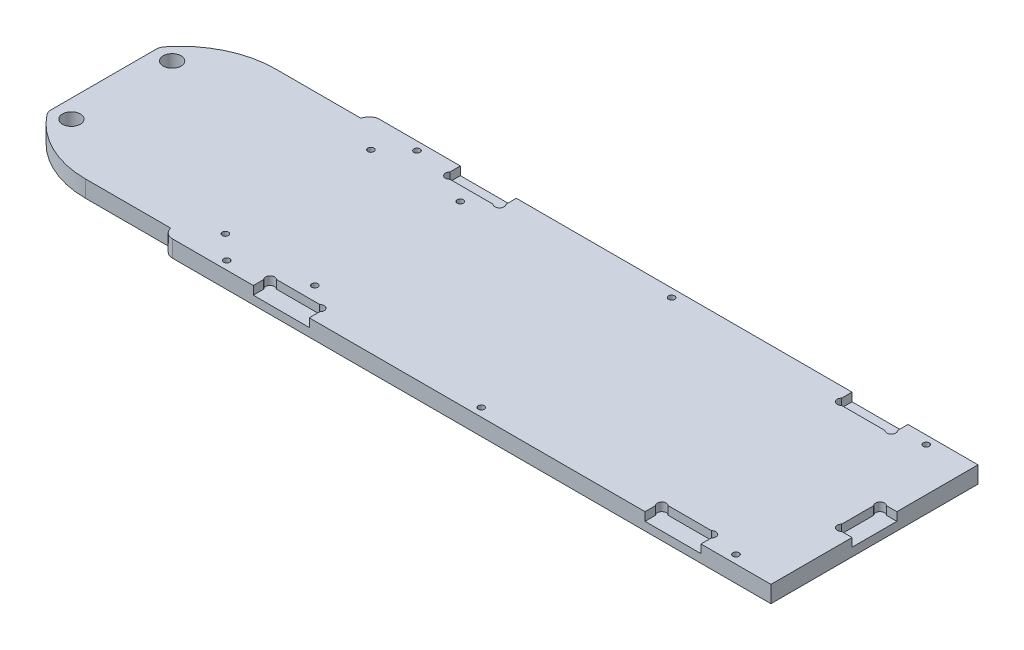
from build123d import *

# Parameters (mm, degrees)
ESQUISSE1_R             = 1.1
ESQUISSE1_R_2           = 3.2
BOSS_EXTRU_1_DEPTH      = 6
ENL_V_MAT_EXTRU_1_DEPTH = 3
CONG_2_R                = 3.7


with BuildPart() as part:
    # Esquisse1 → Boss.-Extru.1 (new body)
    with BuildSketch(Plane(origin=(0, 0, 0), x_dir=(1, 0, 0), z_dir=(0, 1, 0))):
        with BuildLine():
            Line((-38, 71.000000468), (-7.5, 71.000000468))
            ThreePointArc((-7.5, 71.000000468), (-6.222663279, 73.153068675), (-3.866819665, 74))
            Line((-3.866819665, 74), (210, 74))
            Line((210, 74), (210, 0))
            Line((210, 0), (-3.866819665, 0))
            ThreePointArc((-3.866819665, 0), (-6.222663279, 0.846931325), (-7.5, 2.999999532))
            Line((-7.5, 2.999999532), (-38, 2.999999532))
            ThreePointArc((-38, 2.999999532), (-53.430692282, 6.703238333), (-65.5, 17.006250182))
            Line((-65.5, 17.006250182), (-65.5, 56.993749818))
            ThreePointArc((-65.5, 56.993749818), (-53.430692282, 67.296761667), (-38, 71.000000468))
        make_face()
        with Locations(Location((12.5, 71.000000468, 0), (0, 0, 270))):
            Circle(ESQUISSE1_R, mode=Mode.SUBTRACT)
        with Locations(Location((194.5, 71.000000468, 0), (0, 0, 90))):
            Circle(ESQUISSE1_R, mode=Mode.SUBTRACT)
        with Locations(Location((103.5, 71, 0), (0, 0, 270))):
            Circle(ESQUISSE1_R, mode=Mode.SUBTRACT)
        with Locations(Location((103.5, 3, 0), (0, 0, 90))):
            Circle(ESQUISSE1_R, mode=Mode.SUBTRACT)
        with Locations(Location((194.5, 2.999999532, 0), (0, 0, 270))):
            Circle(ESQUISSE1_R, mode=Mode.SUBTRACT)
        with Locations(Location((12.5, 2.999999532, 0), (0, 0, 90))):
            Circle(ESQUISSE1_R, mode=Mode.SUBTRACT)
        with Locations(Location((4, 63, 0), (0, 0, 270))):
            Circle(ESQUISSE1_R, mode=Mode.SUBTRACT)
        with Locations(Location((36, 63, 0), (0, 0, 90))):
            Circle(ESQUISSE1_R, mode=Mode.SUBTRACT)
        with Locations(Location((36, 11, 0), (0, 0, 270))):
            Circle(ESQUISSE1_R, mode=Mode.SUBTRACT)
        with Locations(Location((4, 11, 0), (0, 0, 90))):
            Circle(ESQUISSE1_R, mode=Mode.SUBTRACT)
        with Locations(Location((-59, 55, 0), (0, 0, 270))):
            Circle(ESQUISSE1_R_2, mode=Mode.SUBTRACT)
        with Locations(Location((-59, 19, 0), (0, 0, 90))):
            Circle(ESQUISSE1_R_2, mode=Mode.SUBTRACT)
    extrude(amount=BOSS_EXTRU_1_DEPTH)

    # Esquisse2 → Enl_v. mat.-Extru.1 (cut)
    with BuildSketch(Plane(origin=(0, 6, 0), x_dir=(1, 0, 0), z_dir=(0, 1, 0))):
        with BuildLine():
            Line((27.2627417, 68), (42.7372583, 68))
            ThreePointArc((42.7372583, 68), (45, 68), (45, 70.2627417))
            Line((45, 70.2627417), (45, 74))
            Line((45, 74), (25, 74))
            Line((25, 74), (25, 70.2627417))
            ThreePointArc((25, 70.2627417), (25, 68), (27.2627417, 68))
        make_face()
        with BuildLine():
            Line((165, 70.2627417), (165, 74))
            Line((165, 74), (185, 74))
            Line((185, 74), (185, 70.2627417))
            ThreePointArc((185, 70.2627417), (185, 68), (182.7372583, 68))
            Line((182.7372583, 68), (167.2627417, 68))
            ThreePointArc((167.2627417, 68), (165, 68), (165, 70.2627417))
        make_face()
        with BuildLine():
            Line((165, 0), (185, 0))
            Line((185, 0), (185, 3.7372583))
            ThreePointArc((185, 3.7372583), (185, 6), (182.7372583, 6))
            Line((182.7372583, 6), (167.2627417, 6))
            ThreePointArc((167.2627417, 6), (165, 6), (165, 3.7372583))
            Line((165, 3.7372583), (165, 0))
        make_face()
        with BuildLine():
            Line((45, 3.7372583), (45, 0))
            Line((45, 0), (25, 0))
            Line((25, 0), (25, 3.7372583))
            ThreePointArc((25, 3.7372583), (25, 6), (27.2627417, 6))
            Line((27.2627417, 6), (42.7372583, 6))
            ThreePointArc((42.7372583, 6), (45, 6), (45, 3.7372583))
        make_face()
        with BuildLine():
            Line((204, 42.7372583), (204, 31.2627417))
            ThreePointArc((204, 31.2627417), (204, 29), (206.2627417, 29))
            Line((206.2627417, 29), (210, 29))
            Line((210, 29), (210, 45))
            Line((210, 45), (206.2627417, 45))
            ThreePointArc((206.2627417, 45), (204, 45), (204, 42.7372583))
        make_face()
    extrude(amount=-ENL_V_MAT_EXTRU_1_DEPTH, mode=Mode.SUBTRACT)

    # Cong_2
    cong_2_edges = [part.edges().sort_by_distance(p)[0] for p in [
        (-65.5, 3, -17.006250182),
        (-65.5, 3, -56.993749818),
    ]]
    fillet(cong_2_edges, radius=CONG_2_R)


solid = part.part
